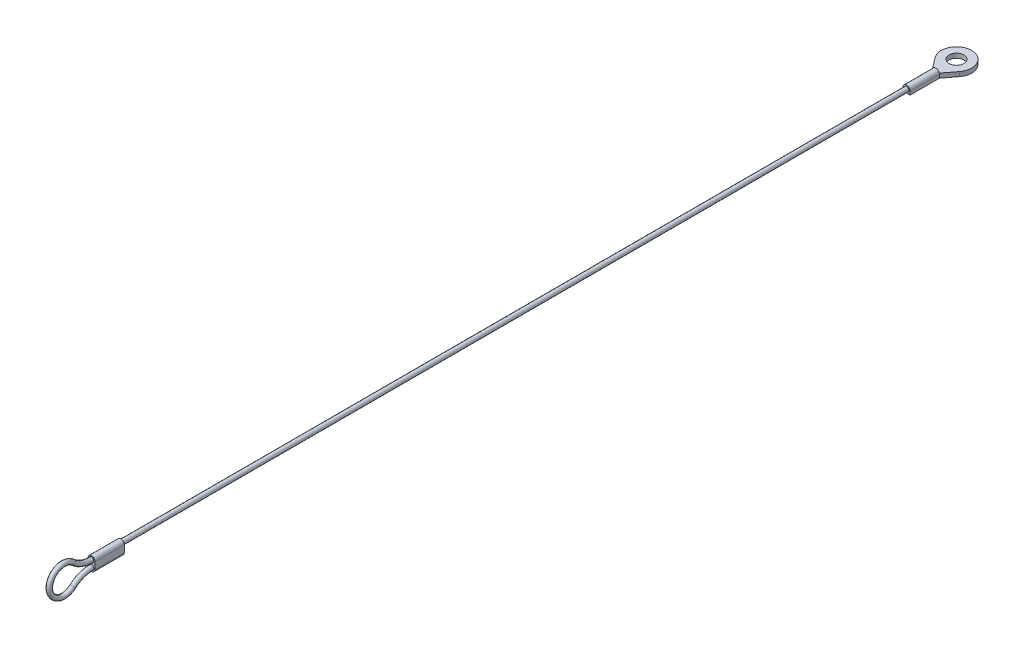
ISO-10303-21;
HEADER;
FILE_DESCRIPTION(('STEP AP214'),'2;1');
FILE_NAME('part.step','',(''),(''),'','','');
FILE_SCHEMA(('AUTOMOTIVE_DESIGN { 1 0 10303 214 1 1 1 1 }'));
ENDSEC;
DATA;
#1=APPLICATION_CONTEXT('core data for automotive mechanical design processes');
#2=APPLICATION_PROTOCOL_DEFINITION('international standard','automotive_design',2000,#1);
#3=PRODUCT_CONTEXT('',#1,'mechanical');
#4=PRODUCT('Part','Part','',(#3));
#5=PRODUCT_RELATED_PRODUCT_CATEGORY('part','',(#4));
#6=PRODUCT_DEFINITION_FORMATION('','',#4);
#7=PRODUCT_DEFINITION_CONTEXT('part definition',#1,'design');
#8=PRODUCT_DEFINITION('design','',#6,#7);
#9=PRODUCT_DEFINITION_SHAPE('','',#8);
#10=(LENGTH_UNIT() NAMED_UNIT(*) SI_UNIT(.MILLI.,.METRE.));
#11=(NAMED_UNIT(*) PLANE_ANGLE_UNIT() SI_UNIT($,.RADIAN.));
#12=(NAMED_UNIT(*) SI_UNIT($,.STERADIAN.) SOLID_ANGLE_UNIT());
#13=UNCERTAINTY_MEASURE_WITH_UNIT(LENGTH_MEASURE(1.E-05),#10,'distance_accuracy_value','');
#14=(GEOMETRIC_REPRESENTATION_CONTEXT(3) GLOBAL_UNCERTAINTY_ASSIGNED_CONTEXT((#13)) GLOBAL_UNIT_ASSIGNED_CONTEXT((#10,
#11,#12)) REPRESENTATION_CONTEXT('',''));
#15=CARTESIAN_POINT('',(0.,0.,0.));
#16=DIRECTION('',(0.,0.,1.));
#17=DIRECTION('',(1.,0.,0.));
#18=AXIS2_PLACEMENT_3D('',#15,#16,#17);
#19=CARTESIAN_POINT('',(0.,0.,-10.));
#20=DIRECTION('',(0.,0.,-1.));
#21=DIRECTION('',(-1.,0.,0.));
#22=AXIS2_PLACEMENT_3D('',#19,#20,#21);
#23=PLANE('',#22);
#24=CARTESIAN_POINT('',(0.,0.,-10.));
#25=DIRECTION('',(0.,0.,-1.));
#26=DIRECTION('',(-1.,0.,0.));
#27=AXIS2_PLACEMENT_3D('',#24,#25,#26);
#28=CIRCLE('',#27,1.195);
#29=CARTESIAN_POINT('',(-1.1499565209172,0.325,-10.));
#30=VERTEX_POINT('',#29);
#31=CARTESIAN_POINT('',(1.1499565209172,0.325,-10.));
#32=VERTEX_POINT('',#31);
#33=EDGE_CURVE('E200',#30,#32,#28,.T.);
#34=ORIENTED_EDGE('',*,*,#33,.T.);
#35=DIRECTION('',(-1.,0.,0.));
#36=VECTOR('',#35,1.);
#37=CARTESIAN_POINT('',(-1.195,0.325,-10.));
#38=LINE('',#37,#36);
#39=EDGE_CURVE('E11',#32,#30,#38,.T.);
#40=ORIENTED_EDGE('',*,*,#39,.T.);
#41=EDGE_LOOP('',(#34,#40));
#42=FACE_BOUND('',#41,.T.);
#43=ADVANCED_FACE('F39',(#42),#23,.T.);
#44=CARTESIAN_POINT('',(0.,0.,278.2));
#45=DIRECTION('',(0.,0.,-1.));
#46=DIRECTION('',(-1.,0.,0.));
#47=AXIS2_PLACEMENT_3D('',#44,#45,#46);
#48=CYLINDRICAL_SURFACE('',#47,0.795);
#49=CARTESIAN_POINT('',(0.,0.,268.2));
#50=DIRECTION('',(0.,0.,-1.));
#51=DIRECTION('',(0.,1.,0.));
#52=AXIS2_PLACEMENT_3D('',#49,#50,#51);
#53=CIRCLE('',#52,0.795);
#54=CARTESIAN_POINT('',(0.,0.795,268.2));
#55=VERTEX_POINT('',#54);
#56=EDGE_CURVE('E43',#55,#55,#53,.T.);
#57=ORIENTED_EDGE('',*,*,#56,.T.);
#58=EDGE_LOOP('',(#57));
#59=FACE_BOUND('',#58,.T.);
#60=CARTESIAN_POINT('',(0.,0.,0.));
#61=DIRECTION('',(0.,0.,1.));
#62=DIRECTION('',(1.,0.,0.));
#63=AXIS2_PLACEMENT_3D('',#60,#61,#62);
#64=CIRCLE('',#63,0.795);
#65=CARTESIAN_POINT('',(0.795,0.,0.));
#66=VERTEX_POINT('',#65);
#67=EDGE_CURVE('E236',#66,#66,#64,.T.);
#68=ORIENTED_EDGE('',*,*,#67,.T.);
#69=EDGE_LOOP('',(#68));
#70=FACE_BOUND('',#69,.T.);
#71=ADVANCED_FACE('F41',(#59,#70),#48,.T.);
#72=CARTESIAN_POINT('',(0.,3.87710696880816E-13,268.2));
#73=DIRECTION('',(0.,0.,1.));
#74=DIRECTION('',(0.,-1.,0.));
#75=AXIS2_PLACEMENT_3D('',#72,#73,#74);
#76=CYLINDRICAL_SURFACE('',#75,1.195);
#77=CARTESIAN_POINT('',(0.,4.0216672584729E-13,278.2));
#78=DIRECTION('',(0.,0.,-1.));
#79=DIRECTION('',(0.,1.,0.));
#80=AXIS2_PLACEMENT_3D('',#77,#78,#79);
#81=CIRCLE('',#80,1.195);
#82=CARTESIAN_POINT('',(-1.195,4.02313071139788E-13,278.2));
#83=VERTEX_POINT('',#82);
#84=CARTESIAN_POINT('',(1.195,4.02020380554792E-13,278.2));
#85=VERTEX_POINT('',#84);
#86=EDGE_CURVE('E247',#83,#85,#81,.T.);
#87=ORIENTED_EDGE('',*,*,#86,.T.);
#88=DIRECTION('',(0.,0.,1.));
#89=VECTOR('',#88,1.);
#90=CARTESIAN_POINT('',(1.195,3.87564351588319E-13,268.2));
#91=LINE('',#90,#89);
#92=CARTESIAN_POINT('',(1.195,3.87564351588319E-13,268.2));
#93=VERTEX_POINT('',#92);
#94=EDGE_CURVE('E268',#93,#85,#91,.T.);
#95=ORIENTED_EDGE('',*,*,#94,.F.);
#96=CARTESIAN_POINT('',(0.,3.87710696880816E-13,268.2));
#97=DIRECTION('',(0.,0.,-1.));
#98=DIRECTION('',(0.,1.,0.));
#99=AXIS2_PLACEMENT_3D('',#96,#97,#98);
#100=CIRCLE('',#99,1.195);
#101=CARTESIAN_POINT('',(-1.195,3.87857042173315E-13,268.2));
#102=VERTEX_POINT('',#101);
#103=EDGE_CURVE('E237',#102,#93,#100,.T.);
#104=ORIENTED_EDGE('',*,*,#103,.F.);
#105=DIRECTION('',(0.,0.,1.));
#106=VECTOR('',#105,1.);
#107=CARTESIAN_POINT('',(-1.195,3.87857042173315E-13,268.2));
#108=LINE('',#107,#106);
#109=EDGE_CURVE('E246',#102,#83,#108,.T.);
#110=ORIENTED_EDGE('',*,*,#109,.T.);
#111=EDGE_LOOP('',(#87,#95,#104,#110));
#112=FACE_BOUND('',#111,.T.);
#113=ADVANCED_FACE('F329',(#112),#76,.T.);
#114=CARTESIAN_POINT('',(1.195,3.87564351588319E-13,268.2));
#115=DIRECTION('',(-1.,0.,0.));
#116=DIRECTION('',(0.,-1.,0.));
#117=AXIS2_PLACEMENT_3D('',#114,#115,#116);
#118=PLANE('',#117);
#119=DIRECTION('',(0.,-1.,0.));
#120=VECTOR('',#119,1.);
#121=CARTESIAN_POINT('',(1.195,4.02020380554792E-13,278.2));
#122=LINE('',#121,#120);
#123=CARTESIAN_POINT('',(1.195,-2.26625258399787,278.2));
#124=VERTEX_POINT('',#123);
#125=EDGE_CURVE('E251',#85,#124,#122,.T.);
#126=ORIENTED_EDGE('',*,*,#125,.T.);
#127=DIRECTION('',(0.,0.,1.));
#128=VECTOR('',#127,1.);
#129=CARTESIAN_POINT('',(1.195,-2.26625258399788,268.2));
#130=LINE('',#129,#128);
#131=CARTESIAN_POINT('',(1.195,-2.26625258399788,268.2));
#132=VERTEX_POINT('',#131);
#133=EDGE_CURVE('E264',#132,#124,#130,.T.);
#134=ORIENTED_EDGE('',*,*,#133,.F.);
#135=DIRECTION('',(0.,-1.,0.));
#136=VECTOR('',#135,1.);
#137=CARTESIAN_POINT('',(1.195,3.87564351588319E-13,268.2));
#138=LINE('',#137,#136);
#139=EDGE_CURVE('E96',#93,#132,#138,.T.);
#140=ORIENTED_EDGE('',*,*,#139,.F.);
#141=ORIENTED_EDGE('',*,*,#94,.T.);
#142=EDGE_LOOP('',(#126,#134,#140,#141));
#143=FACE_BOUND('',#142,.T.);
#144=ADVANCED_FACE('F358',(#143),#118,.F.);
#145=CARTESIAN_POINT('',(0.,-2.26625258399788,268.2));
#146=DIRECTION('',(0.,0.,1.));
#147=DIRECTION('',(0.,-1.,0.));
#148=AXIS2_PLACEMENT_3D('',#145,#146,#147);
#149=CYLINDRICAL_SURFACE('',#148,1.195);
#150=CARTESIAN_POINT('',(0.,-2.26625258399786,278.2));
#151=DIRECTION('',(0.,0.,-1.));
#152=DIRECTION('',(0.,1.,0.));
#153=AXIS2_PLACEMENT_3D('',#150,#151,#152);
#154=CIRCLE('',#153,1.195);
#155=CARTESIAN_POINT('',(-1.195,-2.26625258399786,278.2));
#156=VERTEX_POINT('',#155);
#157=EDGE_CURVE('E254',#124,#156,#154,.T.);
#158=ORIENTED_EDGE('',*,*,#157,.T.);
#159=DIRECTION('',(0.,0.,1.));
#160=VECTOR('',#159,1.);
#161=CARTESIAN_POINT('',(-1.195,-2.26625258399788,268.2));
#162=LINE('',#161,#160);
#163=CARTESIAN_POINT('',(-1.195,-2.26625258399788,268.2));
#164=VERTEX_POINT('',#163);
#165=EDGE_CURVE('E261',#164,#156,#162,.T.);
#166=ORIENTED_EDGE('',*,*,#165,.F.);
#167=CARTESIAN_POINT('',(0.,-2.26625258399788,268.2));
#168=DIRECTION('',(0.,0.,-1.));
#169=DIRECTION('',(0.,1.,0.));
#170=AXIS2_PLACEMENT_3D('',#167,#168,#169);
#171=CIRCLE('',#170,1.195);
#172=EDGE_CURVE('E241',#132,#164,#171,.T.);
#173=ORIENTED_EDGE('',*,*,#172,.F.);
#174=ORIENTED_EDGE('',*,*,#133,.T.);
#175=EDGE_LOOP('',(#158,#166,#173,#174));
#176=FACE_BOUND('',#175,.T.);
#177=ADVANCED_FACE('F355',(#176),#149,.T.);
#178=CARTESIAN_POINT('',(-1.195,3.87857042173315E-13,268.2));
#179=DIRECTION('',(1.,0.,0.));
#180=DIRECTION('',(0.,0.,-1.));
#181=AXIS2_PLACEMENT_3D('',#178,#179,#180);
#182=PLANE('',#181);
#183=DIRECTION('',(0.,1.,0.));
#184=VECTOR('',#183,1.);
#185=CARTESIAN_POINT('',(-1.195,4.02313071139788E-13,278.2));
#186=LINE('',#185,#184);
#187=EDGE_CURVE('E88',#156,#83,#186,.T.);
#188=ORIENTED_EDGE('',*,*,#187,.T.);
#189=ORIENTED_EDGE('',*,*,#109,.F.);
#190=DIRECTION('',(0.,1.,0.));
#191=VECTOR('',#190,1.);
#192=CARTESIAN_POINT('',(-1.195,3.87857042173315E-13,268.2));
#193=LINE('',#192,#191);
#194=EDGE_CURVE('E67',#164,#102,#193,.T.);
#195=ORIENTED_EDGE('',*,*,#194,.F.);
#196=ORIENTED_EDGE('',*,*,#165,.T.);
#197=EDGE_LOOP('',(#188,#189,#195,#196));
#198=FACE_BOUND('',#197,.T.);
#199=ADVANCED_FACE('F347',(#198),#182,.F.);
#200=CARTESIAN_POINT('',(0.,3.87710696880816E-13,268.2));
#201=DIRECTION('',(0.,0.,-1.));
#202=DIRECTION('',(0.,1.,0.));
#203=AXIS2_PLACEMENT_3D('',#200,#201,#202);
#204=PLANE('',#203);
#205=ORIENTED_EDGE('',*,*,#56,.F.);
#206=EDGE_LOOP('',(#205));
#207=FACE_BOUND('',#206,.T.);
#208=ORIENTED_EDGE('',*,*,#103,.T.);
#209=ORIENTED_EDGE('',*,*,#139,.T.);
#210=ORIENTED_EDGE('',*,*,#172,.T.);
#211=ORIENTED_EDGE('',*,*,#194,.T.);
#212=EDGE_LOOP('',(#208,#209,#210,#211));
#213=FACE_BOUND('',#212,.T.);
#214=ADVANCED_FACE('F343',(#207,#213),#204,.T.);
#215=CARTESIAN_POINT('',(0.,4.0216672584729E-13,278.2));
#216=DIRECTION('',(0.,0.,-1.));
#217=DIRECTION('',(0.,1.,0.));
#218=AXIS2_PLACEMENT_3D('',#215,#216,#217);
#219=PLANE('',#218);
#220=CARTESIAN_POINT('',(0.,-2.26625258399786,278.2));
#221=DIRECTION('',(0.,0.,-1.));
#222=DIRECTION('',(1.,0.,0.));
#223=AXIS2_PLACEMENT_3D('',#220,#221,#222);
#224=CIRCLE('',#223,0.795);
#225=CARTESIAN_POINT('',(0.,-1.47125258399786,278.2));
#226=VERTEX_POINT('',#225);
#227=EDGE_CURVE('E275',#226,#226,#224,.T.);
#228=ORIENTED_EDGE('',*,*,#227,.T.);
#229=EDGE_LOOP('',(#228));
#230=FACE_BOUND('',#229,.T.);
#231=CARTESIAN_POINT('',(0.,0.,278.2));
#232=DIRECTION('',(0.,0.,-1.));
#233=DIRECTION('',(0.,1.,0.));
#234=AXIS2_PLACEMENT_3D('',#231,#232,#233);
#235=CIRCLE('',#234,0.795);
#236=CARTESIAN_POINT('',(0.,-0.794999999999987,278.2));
#237=VERTEX_POINT('',#236);
#238=EDGE_CURVE('E271',#237,#237,#235,.T.);
#239=ORIENTED_EDGE('',*,*,#238,.T.);
#240=EDGE_LOOP('',(#239));
#241=FACE_BOUND('',#240,.T.);
#242=ORIENTED_EDGE('',*,*,#86,.F.);
#243=ORIENTED_EDGE('',*,*,#187,.F.);
#244=ORIENTED_EDGE('',*,*,#157,.F.);
#245=ORIENTED_EDGE('',*,*,#125,.F.);
#246=EDGE_LOOP('',(#242,#243,#244,#245));
#247=FACE_BOUND('',#246,.T.);
#248=ADVANCED_FACE('F346',(#230,#241,#247),#219,.F.);
#249=CARTESIAN_POINT('',(0.,-11.8662525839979,278.2));
#250=DIRECTION('',(1.,0.,0.));
#251=DIRECTION('',(0.,0.,-1.));
#252=AXIS2_PLACEMENT_3D('',#249,#250,#251);
#253=TOROIDAL_SURFACE('',#252,9.6,0.795);
#254=CARTESIAN_POINT('',(0.,-4.7108350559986,284.6));
#255=DIRECTION('',(0.,0.666666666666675,-0.745355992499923));
#256=DIRECTION('',(1.,0.,0.));
#257=AXIS2_PLACEMENT_3D('',#254,#255,#256);
#258=CIRCLE('',#257,0.795);
#259=CARTESIAN_POINT('',(0.,-4.11827704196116,285.13));
#260=VERTEX_POINT('',#259);
#261=EDGE_CURVE('E279',#260,#260,#258,.T.);
#262=CARTESIAN_POINT('',(0.,-11.8662525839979,278.2));
#263=DIRECTION('',(1.,0.,0.));
#264=DIRECTION('',(0.,0.,-1.));
#265=AXIS2_PLACEMENT_3D('',#262,#263,#264);
#266=CIRCLE('',#265,10.395);
#267=EDGE_CURVE('',#226,#260,#266,.T.);
#268=ORIENTED_EDGE('',*,*,#227,.F.);
#269=ORIENTED_EDGE('',*,*,#261,.T.);
#270=ORIENTED_EDGE('',*,*,#267,.T.);
#271=ORIENTED_EDGE('',*,*,#267,.F.);
#272=EDGE_LOOP('',(#268,#270,#269,#271));
#273=FACE_BOUND('',#272,.T.);
#274=ADVANCED_FACE('F351',(#273),#253,.T.);
#275=CARTESIAN_POINT('',(0.,-1.13312629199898,287.8));
#276=DIRECTION('',(-1.,0.,0.));
#277=DIRECTION('',(0.,0.,1.));
#278=AXIS2_PLACEMENT_3D('',#275,#276,#277);
#279=TOROIDAL_SURFACE('',#278,4.8,0.795);
#280=CARTESIAN_POINT('',(0.,2.44458247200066,284.6));
#281=DIRECTION('',(0.,0.666666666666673,0.745355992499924));
#282=DIRECTION('',(1.,0.,0.));
#283=AXIS2_PLACEMENT_3D('',#280,#281,#282);
#284=CIRCLE('',#283,0.795);
#285=CARTESIAN_POINT('',(0.,1.85202445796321,285.13));
#286=VERTEX_POINT('',#285);
#287=EDGE_CURVE('E49',#286,#286,#284,.T.);
#288=ORIENTED_EDGE('',*,*,#287,.T.);
#289=EDGE_LOOP('',(#288));
#290=FACE_BOUND('',#289,.T.);
#291=ORIENTED_EDGE('',*,*,#261,.F.);
#292=EDGE_LOOP('',(#291));
#293=FACE_BOUND('',#292,.T.);
#294=ADVANCED_FACE('F367',(#290,#293),#279,.T.);
#295=CARTESIAN_POINT('',(0.,9.6,278.2));
#296=DIRECTION('',(1.,0.,0.));
#297=DIRECTION('',(0.,0.,-1.));
#298=AXIS2_PLACEMENT_3D('',#295,#296,#297);
#299=TOROIDAL_SURFACE('',#298,9.59999999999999,0.795);
#300=CARTESIAN_POINT('',(0.,9.6,278.2));
#301=DIRECTION('',(1.,0.,0.));
#302=DIRECTION('',(0.,0.,-1.));
#303=AXIS2_PLACEMENT_3D('',#300,#301,#302);
#304=CIRCLE('',#303,10.395);
#305=EDGE_CURVE('',#286,#237,#304,.T.);
#306=ORIENTED_EDGE('',*,*,#287,.F.);
#307=ORIENTED_EDGE('',*,*,#238,.F.);
#308=ORIENTED_EDGE('',*,*,#305,.T.);
#309=ORIENTED_EDGE('',*,*,#305,.F.);
#310=EDGE_LOOP('',(#306,#308,#307,#309));
#311=FACE_BOUND('',#310,.T.);
#312=ADVANCED_FACE('F342',(#311),#299,.T.);
#313=CARTESIAN_POINT('',(0.,0.,-10.));
#314=DIRECTION('',(0.,0.,1.));
#315=DIRECTION('',(1.,0.,0.));
#316=AXIS2_PLACEMENT_3D('',#313,#314,#315);
#317=CYLINDRICAL_SURFACE('',#316,1.195);
#318=CARTESIAN_POINT('',(0.,0.,0.));
#319=DIRECTION('',(0.,0.,-1.));
#320=DIRECTION('',(-1.,0.,0.));
#321=AXIS2_PLACEMENT_3D('',#318,#319,#320);
#322=CIRCLE('',#321,1.195);
#323=CARTESIAN_POINT('',(-1.195,0.,0.));
#324=VERTEX_POINT('',#323);
#325=CARTESIAN_POINT('',(1.195,0.,0.));
#326=VERTEX_POINT('',#325);
#327=EDGE_CURVE('E189',#324,#326,#322,.T.);
#328=ORIENTED_EDGE('',*,*,#327,.T.);
#329=DIRECTION('',(0.,0.,1.));
#330=VECTOR('',#329,1.);
#331=CARTESIAN_POINT('',(1.195,0.,-10.));
#332=LINE('',#331,#330);
#333=CARTESIAN_POINT('',(1.195,0.,-10.));
#334=VERTEX_POINT('',#333);
#335=EDGE_CURVE('E232',#334,#326,#332,.T.);
#336=ORIENTED_EDGE('',*,*,#335,.F.);
#337=EDGE_CURVE('E201',#32,#334,#28,.T.);
#338=ORIENTED_EDGE('',*,*,#337,.F.);
#339=ORIENTED_EDGE('',*,*,#33,.F.);
#340=CARTESIAN_POINT('',(-1.195,0.,-10.));
#341=VERTEX_POINT('',#340);
#342=EDGE_CURVE('E196',#341,#30,#28,.T.);
#343=ORIENTED_EDGE('',*,*,#342,.F.);
#344=DIRECTION('',(0.,0.,1.));
#345=VECTOR('',#344,1.);
#346=CARTESIAN_POINT('',(-1.195,0.,-10.));
#347=LINE('',#346,#345);
#348=EDGE_CURVE('E207',#341,#324,#347,.T.);
#349=ORIENTED_EDGE('',*,*,#348,.T.);
#350=EDGE_LOOP('',(#328,#336,#338,#339,#343,#349));
#351=FACE_BOUND('',#350,.T.);
#352=ADVANCED_FACE('F300',(#351),#317,.T.);
#353=CARTESIAN_POINT('',(1.195,0.,-10.));
#354=DIRECTION('',(-1.,0.,0.));
#355=DIRECTION('',(0.,-1.,0.));
#356=AXIS2_PLACEMENT_3D('',#353,#354,#355);
#357=PLANE('',#356);
#358=DIRECTION('',(0.,-1.,0.));
#359=VECTOR('',#358,1.);
#360=CARTESIAN_POINT('',(1.195,0.,0.));
#361=LINE('',#360,#359);
#362=CARTESIAN_POINT('',(1.195,-1.195,0.));
#363=VERTEX_POINT('',#362);
#364=EDGE_CURVE('E211',#326,#363,#361,.T.);
#365=ORIENTED_EDGE('',*,*,#364,.T.);
#366=DIRECTION('',(0.,0.,1.));
#367=VECTOR('',#366,1.);
#368=CARTESIAN_POINT('',(1.195,-1.195,-10.));
#369=LINE('',#368,#367);
#370=CARTESIAN_POINT('',(1.195,-1.195,-10.));
#371=VERTEX_POINT('',#370);
#372=EDGE_CURVE('E228',#371,#363,#369,.T.);
#373=ORIENTED_EDGE('',*,*,#372,.F.);
#374=DIRECTION('',(0.,-1.,0.));
#375=VECTOR('',#374,1.);
#376=CARTESIAN_POINT('',(1.195,0.,-10.));
#377=LINE('',#376,#375);
#378=EDGE_CURVE('E199',#334,#371,#377,.T.);
#379=ORIENTED_EDGE('',*,*,#378,.F.);
#380=ORIENTED_EDGE('',*,*,#335,.T.);
#381=EDGE_LOOP('',(#365,#373,#379,#380));
#382=FACE_BOUND('',#381,.T.);
#383=ADVANCED_FACE('F313',(#382),#357,.F.);
#384=CARTESIAN_POINT('',(0.,-1.195,-10.));
#385=DIRECTION('',(0.,1.,0.));
#386=DIRECTION('',(0.,0.,1.));
#387=AXIS2_PLACEMENT_3D('',#384,#385,#386);
#388=PLANE('',#387);
#389=DIRECTION('',(-1.,0.,0.));
#390=VECTOR('',#389,1.);
#391=CARTESIAN_POINT('',(0.,-1.195,0.));
#392=LINE('',#391,#390);
#393=CARTESIAN_POINT('',(-1.195,-1.195,0.));
#394=VERTEX_POINT('',#393);
#395=EDGE_CURVE('E215',#363,#394,#392,.T.);
#396=ORIENTED_EDGE('',*,*,#395,.T.);
#397=DIRECTION('',(0.,0.,1.));
#398=VECTOR('',#397,1.);
#399=CARTESIAN_POINT('',(-1.195,-1.195,-10.));
#400=LINE('',#399,#398);
#401=CARTESIAN_POINT('',(-1.195,-1.195,-10.));
#402=VERTEX_POINT('',#401);
#403=EDGE_CURVE('E224',#402,#394,#400,.T.);
#404=ORIENTED_EDGE('',*,*,#403,.F.);
#405=DIRECTION('',(-0.608040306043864,0.,-0.793906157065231));
#406=VECTOR('',#405,1.);
#407=CARTESIAN_POINT('',(-4.13228154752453,-1.195,-13.8351502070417));
#408=LINE('',#407,#406);
#409=CARTESIAN_POINT('',(-4.13228154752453,-1.195,-13.8351502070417));
#410=VERTEX_POINT('',#409);
#411=EDGE_CURVE('E182',#402,#410,#408,.T.);
#412=ORIENTED_EDGE('',*,*,#411,.T.);
#413=CARTESIAN_POINT('',(0.,-1.195,-17.));
#414=DIRECTION('',(0.,-1.,0.));
#415=DIRECTION('',(0.,0.,1.));
#416=AXIS2_PLACEMENT_3D('',#413,#414,#415);
#417=CIRCLE('',#416,5.205);
#418=CARTESIAN_POINT('',(4.13228154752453,-1.195,-13.8351502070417));
#419=VERTEX_POINT('',#418);
#420=EDGE_CURVE('E147',#410,#419,#417,.T.);
#421=ORIENTED_EDGE('',*,*,#420,.T.);
#422=DIRECTION('',(-0.608040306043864,0.,0.793906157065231));
#423=VECTOR('',#422,1.);
#424=CARTESIAN_POINT('',(1.195,-1.195,-10.));
#425=LINE('',#424,#423);
#426=EDGE_CURVE('E167',#419,#371,#425,.T.);
#427=ORIENTED_EDGE('',*,*,#426,.T.);
#428=ORIENTED_EDGE('',*,*,#372,.T.);
#429=EDGE_LOOP('',(#396,#404,#412,#421,#427,#428));
#430=FACE_BOUND('',#429,.T.);
#431=CARTESIAN_POINT('',(0.,-1.195,-17.));
#432=DIRECTION('',(0.,-1.,0.));
#433=DIRECTION('',(0.,0.,-1.));
#434=AXIS2_PLACEMENT_3D('',#431,#432,#433);
#435=CIRCLE('',#434,2.54);
#436=CARTESIAN_POINT('',(0.,-1.195,-19.54));
#437=VERTEX_POINT('',#436);
#438=EDGE_CURVE('E175',#437,#437,#435,.T.);
#439=ORIENTED_EDGE('',*,*,#438,.F.);
#440=EDGE_LOOP('',(#439));
#441=FACE_BOUND('',#440,.T.);
#442=ADVANCED_FACE('F309',(#430,#441),#388,.F.);
#443=CARTESIAN_POINT('',(-1.195,-1.195,-10.));
#444=DIRECTION('',(1.,0.,0.));
#445=DIRECTION('',(0.,1.,0.));
#446=AXIS2_PLACEMENT_3D('',#443,#444,#445);
#447=PLANE('',#446);
#448=DIRECTION('',(0.,1.,0.));
#449=VECTOR('',#448,1.);
#450=CARTESIAN_POINT('',(-1.195,-1.195,0.));
#451=LINE('',#450,#449);
#452=EDGE_CURVE('E218',#394,#324,#451,.T.);
#453=ORIENTED_EDGE('',*,*,#452,.T.);
#454=ORIENTED_EDGE('',*,*,#348,.F.);
#455=DIRECTION('',(0.,1.,0.));
#456=VECTOR('',#455,1.);
#457=CARTESIAN_POINT('',(-1.195,-1.195,-10.));
#458=LINE('',#457,#456);
#459=EDGE_CURVE('E204',#402,#341,#458,.T.);
#460=ORIENTED_EDGE('',*,*,#459,.F.);
#461=ORIENTED_EDGE('',*,*,#403,.T.);
#462=EDGE_LOOP('',(#453,#454,#460,#461));
#463=FACE_BOUND('',#462,.T.);
#464=ADVANCED_FACE('F294',(#463),#447,.F.);
#465=CARTESIAN_POINT('',(0.,0.,0.));
#466=DIRECTION('',(0.,0.,-1.));
#467=DIRECTION('',(-1.,0.,0.));
#468=AXIS2_PLACEMENT_3D('',#465,#466,#467);
#469=PLANE('',#468);
#470=ORIENTED_EDGE('',*,*,#67,.F.);
#471=EDGE_LOOP('',(#470));
#472=FACE_BOUND('',#471,.T.);
#473=ORIENTED_EDGE('',*,*,#327,.F.);
#474=ORIENTED_EDGE('',*,*,#452,.F.);
#475=ORIENTED_EDGE('',*,*,#395,.F.);
#476=ORIENTED_EDGE('',*,*,#364,.F.);
#477=EDGE_LOOP('',(#473,#474,#475,#476));
#478=FACE_BOUND('',#477,.T.);
#479=ADVANCED_FACE('F290',(#472,#478),#469,.F.);
#480=CARTESIAN_POINT('',(-1.195,0.325,-10.));
#481=DIRECTION('',(0.,0.,1.));
#482=DIRECTION('',(1.,0.,0.));
#483=AXIS2_PLACEMENT_3D('',#480,#481,#482);
#484=PLANE('',#483);
#485=DIRECTION('',(0.,-1.,0.));
#486=VECTOR('',#485,1.);
#487=CARTESIAN_POINT('',(-1.195,0.325,-10.));
#488=LINE('',#487,#486);
#489=CARTESIAN_POINT('',(-1.195,0.325,-10.));
#490=VERTEX_POINT('',#489);
#491=EDGE_CURVE('E165',#490,#341,#488,.T.);
#492=ORIENTED_EDGE('',*,*,#491,.T.);
#493=ORIENTED_EDGE('',*,*,#342,.T.);
#494=EDGE_CURVE('E52',#30,#490,#38,.T.);
#495=ORIENTED_EDGE('',*,*,#494,.T.);
#496=EDGE_LOOP('',(#492,#493,#495));
#497=FACE_BOUND('',#496,.T.);
#498=ADVANCED_FACE('F293',(#497),#484,.T.);
#499=CARTESIAN_POINT('',(-4.13228154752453,0.325,-13.8351502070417));
#500=DIRECTION('',(-0.793906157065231,0.,0.608040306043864));
#501=DIRECTION('',(0.608040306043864,0.,0.793906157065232));
#502=AXIS2_PLACEMENT_3D('',#499,#500,#501);
#503=PLANE('',#502);
#504=ORIENTED_EDGE('',*,*,#411,.F.);
#505=ORIENTED_EDGE('',*,*,#459,.T.);
#506=ORIENTED_EDGE('',*,*,#491,.F.);
#507=DIRECTION('',(-0.608040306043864,0.,-0.793906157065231));
#508=VECTOR('',#507,1.);
#509=CARTESIAN_POINT('',(-4.13228154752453,0.325,-13.8351502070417));
#510=LINE('',#509,#508);
#511=CARTESIAN_POINT('',(-4.13228154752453,0.325,-13.8351502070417));
#512=VERTEX_POINT('',#511);
#513=EDGE_CURVE('E156',#490,#512,#510,.T.);
#514=ORIENTED_EDGE('',*,*,#513,.T.);
#515=DIRECTION('',(0.,-1.,0.));
#516=VECTOR('',#515,1.);
#517=CARTESIAN_POINT('',(-4.13228154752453,0.325,-13.8351502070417));
#518=LINE('',#517,#516);
#519=EDGE_CURVE('E142',#512,#410,#518,.T.);
#520=ORIENTED_EDGE('',*,*,#519,.T.);
#521=EDGE_LOOP('',(#504,#505,#506,#514,#520));
#522=FACE_BOUND('',#521,.T.);
#523=ADVANCED_FACE('F163',(#522),#503,.T.);
#524=CARTESIAN_POINT('',(1.195,0.325,-10.));
#525=VERTEX_POINT('',#524);
#526=EDGE_CURVE('E51',#525,#32,#38,.T.);
#527=ORIENTED_EDGE('',*,*,#526,.T.);
#528=ORIENTED_EDGE('',*,*,#337,.T.);
#529=DIRECTION('',(0.,-1.,0.));
#530=VECTOR('',#529,1.);
#531=CARTESIAN_POINT('',(1.195,0.325,-10.));
#532=LINE('',#531,#530);
#533=EDGE_CURVE('E190',#525,#334,#532,.T.);
#534=ORIENTED_EDGE('',*,*,#533,.F.);
#535=EDGE_LOOP('',(#527,#528,#534));
#536=FACE_BOUND('',#535,.T.);
#537=ADVANCED_FACE('F319',(#536),#484,.T.);
#538=CARTESIAN_POINT('',(1.195,0.325,-10.));
#539=DIRECTION('',(0.793906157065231,0.,0.608040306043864));
#540=DIRECTION('',(0.608040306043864,0.,-0.793906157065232));
#541=AXIS2_PLACEMENT_3D('',#538,#539,#540);
#542=PLANE('',#541);
#543=ORIENTED_EDGE('',*,*,#426,.F.);
#544=DIRECTION('',(0.,-1.,0.));
#545=VECTOR('',#544,1.);
#546=CARTESIAN_POINT('',(4.13228154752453,0.325,-13.8351502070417));
#547=LINE('',#546,#545);
#548=CARTESIAN_POINT('',(4.13228154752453,0.325,-13.8351502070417));
#549=VERTEX_POINT('',#548);
#550=EDGE_CURVE('E152',#549,#419,#547,.T.);
#551=ORIENTED_EDGE('',*,*,#550,.F.);
#552=DIRECTION('',(-0.608040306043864,0.,0.793906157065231));
#553=VECTOR('',#552,1.);
#554=CARTESIAN_POINT('',(1.195,0.325,-10.));
#555=LINE('',#554,#553);
#556=EDGE_CURVE('E159',#549,#525,#555,.T.);
#557=ORIENTED_EDGE('',*,*,#556,.T.);
#558=ORIENTED_EDGE('',*,*,#533,.T.);
#559=ORIENTED_EDGE('',*,*,#378,.T.);
#560=EDGE_LOOP('',(#543,#551,#557,#558,#559));
#561=FACE_BOUND('',#560,.T.);
#562=ADVANCED_FACE('F317',(#561),#542,.T.);
#563=CARTESIAN_POINT('',(0.,0.325,-17.));
#564=DIRECTION('',(0.,-1.,0.));
#565=DIRECTION('',(0.,0.,-1.));
#566=AXIS2_PLACEMENT_3D('',#563,#564,#565);
#567=CYLINDRICAL_SURFACE('',#566,5.205);
#568=ORIENTED_EDGE('',*,*,#420,.F.);
#569=ORIENTED_EDGE('',*,*,#519,.F.);
#570=CARTESIAN_POINT('',(0.,0.325,-17.));
#571=DIRECTION('',(0.,-1.,0.));
#572=DIRECTION('',(0.,0.,1.));
#573=AXIS2_PLACEMENT_3D('',#570,#571,#572);
#574=CIRCLE('',#573,5.205);
#575=EDGE_CURVE('E145',#512,#549,#574,.T.);
#576=ORIENTED_EDGE('',*,*,#575,.T.);
#577=ORIENTED_EDGE('',*,*,#550,.T.);
#578=EDGE_LOOP('',(#568,#569,#576,#577));
#579=FACE_BOUND('',#578,.T.);
#580=ADVANCED_FACE('F144',(#579),#567,.T.);
#581=CARTESIAN_POINT('',(0.,0.325,-17.));
#582=DIRECTION('',(0.,1.,0.));
#583=DIRECTION('',(0.,0.,1.));
#584=AXIS2_PLACEMENT_3D('',#581,#582,#583);
#585=PLANE('',#584);
#586=CARTESIAN_POINT('',(0.,0.325,-17.));
#587=DIRECTION('',(0.,-1.,0.));
#588=DIRECTION('',(0.,0.,-1.));
#589=AXIS2_PLACEMENT_3D('',#586,#587,#588);
#590=CIRCLE('',#589,2.54);
#591=CARTESIAN_POINT('',(0.,0.325,-19.54));
#592=VERTEX_POINT('',#591);
#593=EDGE_CURVE('E184',#592,#592,#590,.T.);
#594=ORIENTED_EDGE('',*,*,#593,.T.);
#595=EDGE_LOOP('',(#594));
#596=FACE_BOUND('',#595,.T.);
#597=ORIENTED_EDGE('',*,*,#513,.F.);
#598=ORIENTED_EDGE('',*,*,#494,.F.);
#599=ORIENTED_EDGE('',*,*,#39,.F.);
#600=ORIENTED_EDGE('',*,*,#526,.F.);
#601=ORIENTED_EDGE('',*,*,#556,.F.);
#602=ORIENTED_EDGE('',*,*,#575,.F.);
#603=EDGE_LOOP('',(#597,#598,#599,#600,#601,#602));
#604=FACE_BOUND('',#603,.T.);
#605=ADVANCED_FACE('F155',(#596,#604),#585,.T.);
#606=CARTESIAN_POINT('',(0.,0.325,-17.));
#607=DIRECTION('',(0.,-1.,0.));
#608=DIRECTION('',(0.,0.,-1.));
#609=AXIS2_PLACEMENT_3D('',#606,#607,#608);
#610=CYLINDRICAL_SURFACE('',#609,2.54);
#611=ORIENTED_EDGE('',*,*,#593,.F.);
#612=EDGE_LOOP('',(#611));
#613=FACE_BOUND('',#612,.T.);
#614=ORIENTED_EDGE('',*,*,#438,.T.);
#615=EDGE_LOOP('',(#614));
#616=FACE_BOUND('',#615,.T.);
#617=ADVANCED_FACE('F435',(#613,#616),#610,.F.);
#618=CLOSED_SHELL('',(#43,#71,#113,#144,#177,#199,#214,#248,#274,#294,#312,#352,#383,#442,#464,
#479,#498,#523,#537,#562,#580,#605,#617));
#619=MANIFOLD_SOLID_BREP('B2',#618);
#620=ADVANCED_BREP_SHAPE_REPRESENTATION('',(#18,#619),#14);
#621=SHAPE_DEFINITION_REPRESENTATION(#9,#620);
ENDSEC;
END-ISO-10303-21;
